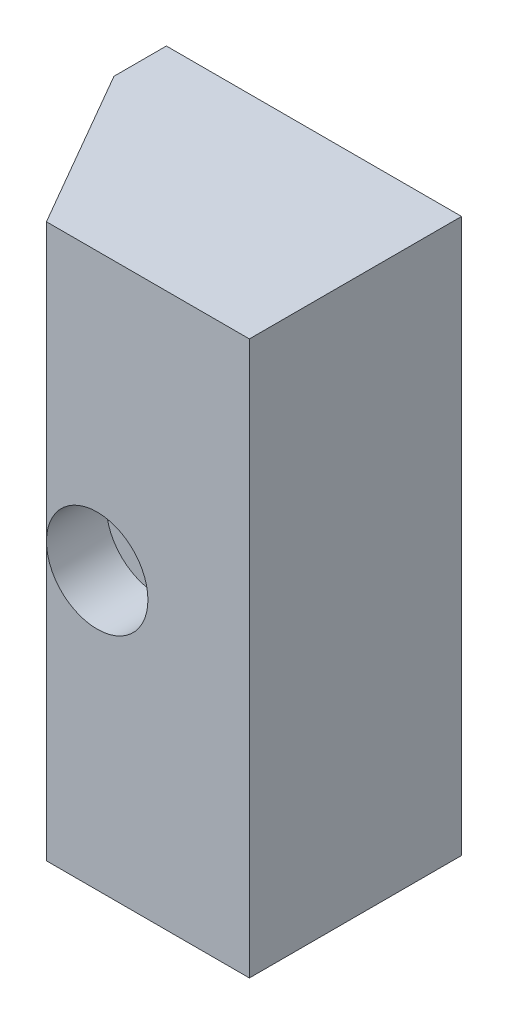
ISO-10303-21;
HEADER;
FILE_DESCRIPTION(('STEP AP214'),'2;1');
FILE_NAME('part.step','',(''),(''),'','','');
FILE_SCHEMA(('AUTOMOTIVE_DESIGN { 1 0 10303 214 1 1 1 1 }'));
ENDSEC;
DATA;
#1=APPLICATION_CONTEXT('core data for automotive mechanical design processes');
#2=APPLICATION_PROTOCOL_DEFINITION('international standard','automotive_design',2000,#1);
#3=PRODUCT_CONTEXT('',#1,'mechanical');
#4=PRODUCT('Part','Part','',(#3));
#5=PRODUCT_RELATED_PRODUCT_CATEGORY('part','',(#4));
#6=PRODUCT_DEFINITION_FORMATION('','',#4);
#7=PRODUCT_DEFINITION_CONTEXT('part definition',#1,'design');
#8=PRODUCT_DEFINITION('design','',#6,#7);
#9=PRODUCT_DEFINITION_SHAPE('','',#8);
#10=(LENGTH_UNIT() NAMED_UNIT(*) SI_UNIT(.MILLI.,.METRE.));
#11=(NAMED_UNIT(*) PLANE_ANGLE_UNIT() SI_UNIT($,.RADIAN.));
#12=(NAMED_UNIT(*) SI_UNIT($,.STERADIAN.) SOLID_ANGLE_UNIT());
#13=UNCERTAINTY_MEASURE_WITH_UNIT(LENGTH_MEASURE(1.E-05),#10,'distance_accuracy_value','');
#14=(GEOMETRIC_REPRESENTATION_CONTEXT(3) GLOBAL_UNCERTAINTY_ASSIGNED_CONTEXT((#13)) GLOBAL_UNIT_ASSIGNED_CONTEXT((#10,
#11,#12)) REPRESENTATION_CONTEXT('',''));
#15=CARTESIAN_POINT('',(0.,0.,0.));
#16=DIRECTION('',(0.,0.,1.));
#17=DIRECTION('',(1.,0.,0.));
#18=AXIS2_PLACEMENT_3D('',#15,#16,#17);
#19=CARTESIAN_POINT('',(16.5,30.,23.));
#20=DIRECTION('',(0.,0.,-1.));
#21=DIRECTION('',(-1.,0.,0.));
#22=AXIS2_PLACEMENT_3D('',#19,#20,#21);
#23=PLANE('',#22);
#24=DIRECTION('',(1.,0.,0.));
#25=VECTOR('',#24,1.);
#26=CARTESIAN_POINT('',(16.5,30.,23.));
#27=LINE('',#26,#25);
#28=CARTESIAN_POINT('',(-5.5,30.,23.));
#29=VERTEX_POINT('',#28);
#30=CARTESIAN_POINT('',(16.5,30.,23.));
#31=VERTEX_POINT('',#30);
#32=EDGE_CURVE('E113',#29,#31,#27,.T.);
#33=ORIENTED_EDGE('',*,*,#32,.F.);
#34=DIRECTION('',(0.,-1.,0.));
#35=VECTOR('',#34,1.);
#36=CARTESIAN_POINT('',(-5.5,30.,23.));
#37=LINE('',#36,#35);
#38=CARTESIAN_POINT('',(-5.5,0.,23.));
#39=VERTEX_POINT('',#38);
#40=EDGE_CURVE('E78',#29,#39,#37,.T.);
#41=ORIENTED_EDGE('',*,*,#40,.T.);
#42=CARTESIAN_POINT('',(0.,0.,23.));
#43=DIRECTION('',(0.,0.,1.));
#44=DIRECTION('',(1.,0.,0.));
#45=AXIS2_PLACEMENT_3D('',#42,#43,#44);
#46=CIRCLE('',#45,5.5);
#47=EDGE_CURVE('E100',#39,#39,#46,.T.);
#48=ORIENTED_EDGE('',*,*,#47,.F.);
#49=CARTESIAN_POINT('',(-5.5,-30.,23.));
#50=VERTEX_POINT('',#49);
#51=EDGE_CURVE('E72',#39,#50,#37,.T.);
#52=ORIENTED_EDGE('',*,*,#51,.T.);
#53=DIRECTION('',(1.,0.,0.));
#54=VECTOR('',#53,1.);
#55=CARTESIAN_POINT('',(16.5,-30.,23.));
#56=LINE('',#55,#54);
#57=CARTESIAN_POINT('',(16.5,-30.,23.));
#58=VERTEX_POINT('',#57);
#59=EDGE_CURVE('E109',#50,#58,#56,.T.);
#60=ORIENTED_EDGE('',*,*,#59,.T.);
#61=DIRECTION('',(0.,-1.,0.));
#62=VECTOR('',#61,1.);
#63=CARTESIAN_POINT('',(16.5,30.,23.));
#64=LINE('',#63,#62);
#65=EDGE_CURVE('E25',#31,#58,#64,.T.);
#66=ORIENTED_EDGE('',*,*,#65,.F.);
#67=EDGE_LOOP('',(#33,#41,#48,#52,#60,#66));
#68=FACE_BOUND('',#67,.T.);
#69=ADVANCED_FACE('F17',(#68),#23,.F.);
#70=CARTESIAN_POINT('',(16.5,30.,23.));
#71=DIRECTION('',(-1.,0.,0.));
#72=DIRECTION('',(0.,-1.,0.));
#73=AXIS2_PLACEMENT_3D('',#70,#71,#72);
#74=PLANE('',#73);
#75=DIRECTION('',(0.,0.,-1.));
#76=VECTOR('',#75,1.);
#77=CARTESIAN_POINT('',(16.5,-30.,23.));
#78=LINE('',#77,#76);
#79=CARTESIAN_POINT('',(16.5,-30.,0.));
#80=VERTEX_POINT('',#79);
#81=EDGE_CURVE('E104',#58,#80,#78,.T.);
#82=ORIENTED_EDGE('',*,*,#81,.T.);
#83=DIRECTION('',(0.,-1.,0.));
#84=VECTOR('',#83,1.);
#85=CARTESIAN_POINT('',(16.5,37.109640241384,0.));
#86=LINE('',#85,#84);
#87=CARTESIAN_POINT('',(16.5,30.,0.));
#88=VERTEX_POINT('',#87);
#89=EDGE_CURVE('E91',#88,#80,#86,.T.);
#90=ORIENTED_EDGE('',*,*,#89,.F.);
#91=DIRECTION('',(0.,0.,-1.));
#92=VECTOR('',#91,1.);
#93=CARTESIAN_POINT('',(16.5,30.,23.));
#94=LINE('',#93,#92);
#95=EDGE_CURVE('E111',#31,#88,#94,.T.);
#96=ORIENTED_EDGE('',*,*,#95,.F.);
#97=ORIENTED_EDGE('',*,*,#65,.T.);
#98=EDGE_LOOP('',(#82,#90,#96,#97));
#99=FACE_BOUND('',#98,.T.);
#100=ADVANCED_FACE('F19',(#99),#74,.F.);
#101=CARTESIAN_POINT('',(16.5,30.,0.00125882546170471));
#102=DIRECTION('',(0.,1.,0.));
#103=DIRECTION('',(-1.,0.,0.));
#104=AXIS2_PLACEMENT_3D('',#101,#102,#103);
#105=PLANE('',#104);
#106=DIRECTION('',(0.5,0.,0.86602540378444));
#107=VECTOR('',#106,1.);
#108=CARTESIAN_POINT('',(-15.5,30.,5.67949192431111));
#109=LINE('',#108,#107);
#110=CARTESIAN_POINT('',(-15.5,30.,5.67949192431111));
#111=VERTEX_POINT('',#110);
#112=EDGE_CURVE('E73',#111,#29,#109,.T.);
#113=ORIENTED_EDGE('',*,*,#112,.T.);
#114=ORIENTED_EDGE('',*,*,#32,.T.);
#115=ORIENTED_EDGE('',*,*,#95,.T.);
#116=DIRECTION('',(1.,0.,0.));
#117=VECTOR('',#116,1.);
#118=CARTESIAN_POINT('',(16.5,30.,0.));
#119=LINE('',#118,#117);
#120=CARTESIAN_POINT('',(-15.5,30.,0.));
#121=VERTEX_POINT('',#120);
#122=EDGE_CURVE('E85',#121,#88,#119,.T.);
#123=ORIENTED_EDGE('',*,*,#122,.F.);
#124=DIRECTION('',(0.,0.,1.));
#125=VECTOR('',#124,1.);
#126=CARTESIAN_POINT('',(-15.5,30.,-1.09118527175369));
#127=LINE('',#126,#125);
#128=EDGE_CURVE('E32',#121,#111,#127,.T.);
#129=ORIENTED_EDGE('',*,*,#128,.T.);
#130=EDGE_LOOP('',(#113,#114,#115,#123,#129));
#131=FACE_BOUND('',#130,.T.);
#132=ADVANCED_FACE('F83',(#131),#105,.T.);
#133=CARTESIAN_POINT('',(16.5,-30.,0.00125882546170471));
#134=DIRECTION('',(0.,1.,0.));
#135=DIRECTION('',(-1.,0.,0.));
#136=AXIS2_PLACEMENT_3D('',#133,#134,#135);
#137=PLANE('',#136);
#138=ORIENTED_EDGE('',*,*,#59,.F.);
#139=DIRECTION('',(0.5,0.,0.86602540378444));
#140=VECTOR('',#139,1.);
#141=CARTESIAN_POINT('',(-15.5,-30.,5.67949192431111));
#142=LINE('',#141,#140);
#143=CARTESIAN_POINT('',(-15.5,-30.,5.67949192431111));
#144=VERTEX_POINT('',#143);
#145=EDGE_CURVE('E86',#144,#50,#142,.T.);
#146=ORIENTED_EDGE('',*,*,#145,.F.);
#147=DIRECTION('',(0.,0.,1.));
#148=VECTOR('',#147,1.);
#149=CARTESIAN_POINT('',(-15.5,-30.,-1.09118527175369));
#150=LINE('',#149,#148);
#151=CARTESIAN_POINT('',(-15.5,-30.,0.));
#152=VERTEX_POINT('',#151);
#153=EDGE_CURVE('E69',#152,#144,#150,.T.);
#154=ORIENTED_EDGE('',*,*,#153,.F.);
#155=DIRECTION('',(1.,0.,0.));
#156=VECTOR('',#155,1.);
#157=CARTESIAN_POINT('',(16.5,-30.,0.));
#158=LINE('',#157,#156);
#159=EDGE_CURVE('E39',#152,#80,#158,.T.);
#160=ORIENTED_EDGE('',*,*,#159,.T.);
#161=ORIENTED_EDGE('',*,*,#81,.F.);
#162=EDGE_LOOP('',(#138,#146,#154,#160,#161));
#163=FACE_BOUND('',#162,.T.);
#164=ADVANCED_FACE('F145',(#163),#137,.F.);
#165=CARTESIAN_POINT('',(0.,0.,16.5));
#166=DIRECTION('',(0.,0.,1.));
#167=DIRECTION('',(1.,0.,0.));
#168=AXIS2_PLACEMENT_3D('',#165,#166,#167);
#169=CYLINDRICAL_SURFACE('',#168,5.5);
#170=CARTESIAN_POINT('',(0.,0.,16.5));
#171=DIRECTION('',(0.,0.,1.));
#172=DIRECTION('',(1.,0.,0.));
#173=AXIS2_PLACEMENT_3D('',#170,#171,#172);
#174=CIRCLE('',#173,5.5);
#175=CARTESIAN_POINT('',(5.5,0.,16.5));
#176=VERTEX_POINT('',#175);
#177=EDGE_CURVE('E101',#176,#176,#174,.T.);
#178=ORIENTED_EDGE('',*,*,#177,.F.);
#179=EDGE_LOOP('',(#178));
#180=FACE_BOUND('',#179,.T.);
#181=ORIENTED_EDGE('',*,*,#47,.T.);
#182=EDGE_LOOP('',(#181));
#183=FACE_BOUND('',#182,.T.);
#184=ADVANCED_FACE('F148',(#180,#183),#169,.F.);
#185=CARTESIAN_POINT('',(0.,0.,16.5));
#186=DIRECTION('',(0.,0.,1.));
#187=DIRECTION('',(1.,0.,0.));
#188=AXIS2_PLACEMENT_3D('',#185,#186,#187);
#189=PLANE('',#188);
#190=CARTESIAN_POINT('',(0.,0.,16.5));
#191=DIRECTION('',(0.,0.,1.));
#192=DIRECTION('',(1.,0.,0.));
#193=AXIS2_PLACEMENT_3D('',#190,#191,#192);
#194=CIRCLE('',#193,3.3);
#195=CARTESIAN_POINT('',(3.3,0.,16.5));
#196=VERTEX_POINT('',#195);
#197=EDGE_CURVE('E97',#196,#196,#194,.T.);
#198=ORIENTED_EDGE('',*,*,#197,.F.);
#199=EDGE_LOOP('',(#198));
#200=FACE_BOUND('',#199,.T.);
#201=ORIENTED_EDGE('',*,*,#177,.T.);
#202=EDGE_LOOP('',(#201));
#203=FACE_BOUND('',#202,.T.);
#204=ADVANCED_FACE('F133',(#200,#203),#189,.T.);
#205=CARTESIAN_POINT('',(0.,0.,0.00125882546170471));
#206=DIRECTION('',(0.,0.,1.));
#207=DIRECTION('',(1.,0.,0.));
#208=AXIS2_PLACEMENT_3D('',#205,#206,#207);
#209=CYLINDRICAL_SURFACE('',#208,3.3);
#210=CARTESIAN_POINT('',(0.,0.,0.));
#211=DIRECTION('',(0.,0.,1.));
#212=DIRECTION('',(0.,-1.,0.));
#213=AXIS2_PLACEMENT_3D('',#210,#211,#212);
#214=CIRCLE('',#213,3.3);
#215=CARTESIAN_POINT('',(0.,-3.3,0.));
#216=VERTEX_POINT('',#215);
#217=EDGE_CURVE('E94',#216,#216,#214,.F.);
#218=ORIENTED_EDGE('',*,*,#217,.T.);
#219=EDGE_LOOP('',(#218));
#220=FACE_BOUND('',#219,.T.);
#221=ORIENTED_EDGE('',*,*,#197,.T.);
#222=EDGE_LOOP('',(#221));
#223=FACE_BOUND('',#222,.T.);
#224=ADVANCED_FACE('F119',(#220,#223),#209,.F.);
#225=CARTESIAN_POINT('',(-15.4998905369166,37.109640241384,0.));
#226=DIRECTION('',(0.,0.,1.));
#227=DIRECTION('',(0.,-1.,0.));
#228=AXIS2_PLACEMENT_3D('',#225,#226,#227);
#229=PLANE('',#228);
#230=ORIENTED_EDGE('',*,*,#159,.F.);
#231=DIRECTION('',(0.,1.,0.));
#232=VECTOR('',#231,1.);
#233=CARTESIAN_POINT('',(-15.5,37.109640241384,0.));
#234=LINE('',#233,#232);
#235=EDGE_CURVE('E10',#152,#121,#234,.T.);
#236=ORIENTED_EDGE('',*,*,#235,.T.);
#237=ORIENTED_EDGE('',*,*,#122,.T.);
#238=ORIENTED_EDGE('',*,*,#89,.T.);
#239=EDGE_LOOP('',(#230,#236,#237,#238));
#240=FACE_BOUND('',#239,.T.);
#241=ORIENTED_EDGE('',*,*,#217,.F.);
#242=EDGE_LOOP('',(#241));
#243=FACE_BOUND('',#242,.T.);
#244=ADVANCED_FACE('F122',(#240,#243),#229,.F.);
#245=CARTESIAN_POINT('',(-15.5,30.,-1.09118527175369));
#246=DIRECTION('',(1.,0.,0.));
#247=DIRECTION('',(0.,0.,-1.));
#248=AXIS2_PLACEMENT_3D('',#245,#246,#247);
#249=PLANE('',#248);
#250=ORIENTED_EDGE('',*,*,#153,.T.);
#251=DIRECTION('',(0.,-1.,0.));
#252=VECTOR('',#251,1.);
#253=CARTESIAN_POINT('',(-15.5,30.,5.67949192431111));
#254=LINE('',#253,#252);
#255=EDGE_CURVE('E66',#111,#144,#254,.T.);
#256=ORIENTED_EDGE('',*,*,#255,.F.);
#257=ORIENTED_EDGE('',*,*,#128,.F.);
#258=ORIENTED_EDGE('',*,*,#235,.F.);
#259=EDGE_LOOP('',(#250,#256,#257,#258));
#260=FACE_BOUND('',#259,.T.);
#261=ADVANCED_FACE('F68',(#260),#249,.F.);
#262=CARTESIAN_POINT('',(-15.5,30.,5.67949192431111));
#263=DIRECTION('',(0.86602540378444,0.,-0.5));
#264=DIRECTION('',(-0.5,0.,-0.86602540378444));
#265=AXIS2_PLACEMENT_3D('',#262,#263,#264);
#266=PLANE('',#265);
#267=ORIENTED_EDGE('',*,*,#145,.T.);
#268=ORIENTED_EDGE('',*,*,#51,.F.);
#269=ORIENTED_EDGE('',*,*,#40,.F.);
#270=ORIENTED_EDGE('',*,*,#112,.F.);
#271=ORIENTED_EDGE('',*,*,#255,.T.);
#272=EDGE_LOOP('',(#267,#268,#269,#270,#271));
#273=FACE_BOUND('',#272,.T.);
#274=ADVANCED_FACE('F76',(#273),#266,.F.);
#275=CLOSED_SHELL('',(#69,#100,#132,#164,#184,#204,#224,#244,#261,#274));
#276=MANIFOLD_SOLID_BREP('B1',#275);
#277=ADVANCED_BREP_SHAPE_REPRESENTATION('',(#18,#276),#14);
#278=SHAPE_DEFINITION_REPRESENTATION(#9,#277);
ENDSEC;
END-ISO-10303-21;
